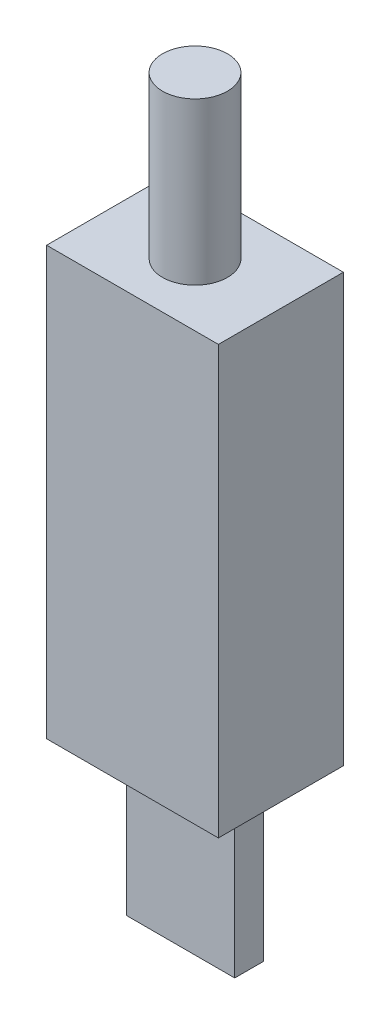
ISO-10303-21;
HEADER;
FILE_DESCRIPTION(('STEP AP214'),'2;1');
FILE_NAME('part.step','',(''),(''),'','','');
FILE_SCHEMA(('AUTOMOTIVE_DESIGN { 1 0 10303 214 1 1 1 1 }'));
ENDSEC;
DATA;
#1=APPLICATION_CONTEXT('core data for automotive mechanical design processes');
#2=APPLICATION_PROTOCOL_DEFINITION('international standard','automotive_design',2000,#1);
#3=PRODUCT_CONTEXT('',#1,'mechanical');
#4=PRODUCT('Part','Part','',(#3));
#5=PRODUCT_RELATED_PRODUCT_CATEGORY('part','',(#4));
#6=PRODUCT_DEFINITION_FORMATION('','',#4);
#7=PRODUCT_DEFINITION_CONTEXT('part definition',#1,'design');
#8=PRODUCT_DEFINITION('design','',#6,#7);
#9=PRODUCT_DEFINITION_SHAPE('','',#8);
#10=(LENGTH_UNIT() NAMED_UNIT(*) SI_UNIT(.MILLI.,.METRE.));
#11=(NAMED_UNIT(*) PLANE_ANGLE_UNIT() SI_UNIT($,.RADIAN.));
#12=(NAMED_UNIT(*) SI_UNIT($,.STERADIAN.) SOLID_ANGLE_UNIT());
#13=UNCERTAINTY_MEASURE_WITH_UNIT(LENGTH_MEASURE(1.E-05),#10,'distance_accuracy_value','');
#14=(GEOMETRIC_REPRESENTATION_CONTEXT(3) GLOBAL_UNCERTAINTY_ASSIGNED_CONTEXT((#13)) GLOBAL_UNIT_ASSIGNED_CONTEXT((#10,
#11,#12)) REPRESENTATION_CONTEXT('',''));
#15=CARTESIAN_POINT('',(0.,0.,0.));
#16=DIRECTION('',(0.,0.,1.));
#17=DIRECTION('',(1.,0.,0.));
#18=AXIS2_PLACEMENT_3D('',#15,#16,#17);
#19=CARTESIAN_POINT('',(0.,10.16,0.));
#20=DIRECTION('',(1.,0.,0.));
#21=DIRECTION('',(0.,0.,-1.));
#22=AXIS2_PLACEMENT_3D('',#19,#20,#21);
#23=PLANE('',#22);
#24=DIRECTION('',(0.,0.,1.));
#25=VECTOR('',#24,1.);
#26=CARTESIAN_POINT('',(0.,0.,0.));
#27=LINE('',#26,#25);
#28=CARTESIAN_POINT('',(0.,0.,-1.8034));
#29=VERTEX_POINT('',#28);
#30=CARTESIAN_POINT('',(0.,0.,0.));
#31=VERTEX_POINT('',#30);
#32=EDGE_CURVE('E132',#29,#31,#27,.T.);
#33=ORIENTED_EDGE('',*,*,#32,.T.);
#34=DIRECTION('',(0.,-1.,0.));
#35=VECTOR('',#34,1.);
#36=CARTESIAN_POINT('',(0.,10.16,0.));
#37=LINE('',#36,#35);
#38=CARTESIAN_POINT('',(0.,10.16,0.));
#39=VERTEX_POINT('',#38);
#40=EDGE_CURVE('E41',#39,#31,#37,.T.);
#41=ORIENTED_EDGE('',*,*,#40,.F.);
#42=DIRECTION('',(0.,0.,1.));
#43=VECTOR('',#42,1.);
#44=CARTESIAN_POINT('',(0.,10.16,0.));
#45=LINE('',#44,#43);
#46=CARTESIAN_POINT('',(0.,10.16,-1.8034));
#47=VERTEX_POINT('',#46);
#48=EDGE_CURVE('E141',#47,#39,#45,.T.);
#49=ORIENTED_EDGE('',*,*,#48,.F.);
#50=DIRECTION('',(0.,-1.,0.));
#51=VECTOR('',#50,1.);
#52=CARTESIAN_POINT('',(0.,10.16,-1.8034));
#53=LINE('',#52,#51);
#54=EDGE_CURVE('E150',#47,#29,#53,.T.);
#55=ORIENTED_EDGE('',*,*,#54,.T.);
#56=EDGE_LOOP('',(#33,#41,#49,#55));
#57=FACE_BOUND('',#56,.T.);
#58=ADVANCED_FACE('F33',(#57),#23,.F.);
#59=CARTESIAN_POINT('',(0.,10.16,0.));
#60=DIRECTION('',(0.,0.,-1.));
#61=DIRECTION('',(-1.,0.,0.));
#62=AXIS2_PLACEMENT_3D('',#59,#60,#61);
#63=PLANE('',#62);
#64=DIRECTION('',(1.,0.,0.));
#65=VECTOR('',#64,1.);
#66=CARTESIAN_POINT('',(0.,0.,0.));
#67=LINE('',#66,#65);
#68=CARTESIAN_POINT('',(6.8072,0.,0.));
#69=VERTEX_POINT('',#68);
#70=EDGE_CURVE('E135',#31,#69,#67,.T.);
#71=ORIENTED_EDGE('',*,*,#70,.T.);
#72=DIRECTION('',(0.,-1.,0.));
#73=VECTOR('',#72,1.);
#74=CARTESIAN_POINT('',(6.8072,10.16,0.));
#75=LINE('',#74,#73);
#76=CARTESIAN_POINT('',(6.8072,10.16,0.));
#77=VERTEX_POINT('',#76);
#78=EDGE_CURVE('E157',#77,#69,#75,.T.);
#79=ORIENTED_EDGE('',*,*,#78,.F.);
#80=DIRECTION('',(1.,0.,0.));
#81=VECTOR('',#80,1.);
#82=CARTESIAN_POINT('',(0.,10.16,0.));
#83=LINE('',#82,#81);
#84=EDGE_CURVE('E76',#39,#77,#83,.T.);
#85=ORIENTED_EDGE('',*,*,#84,.F.);
#86=ORIENTED_EDGE('',*,*,#40,.T.);
#87=EDGE_LOOP('',(#71,#79,#85,#86));
#88=FACE_BOUND('',#87,.T.);
#89=ADVANCED_FACE('F158',(#88),#63,.F.);
#90=CARTESIAN_POINT('',(6.8072,10.16,0.));
#91=DIRECTION('',(-1.,0.,0.));
#92=DIRECTION('',(0.,0.,1.));
#93=AXIS2_PLACEMENT_3D('',#90,#91,#92);
#94=PLANE('',#93);
#95=DIRECTION('',(0.,0.,-1.));
#96=VECTOR('',#95,1.);
#97=CARTESIAN_POINT('',(6.8072,0.,0.));
#98=LINE('',#97,#96);
#99=CARTESIAN_POINT('',(6.8072,0.,-1.8034));
#100=VERTEX_POINT('',#99);
#101=EDGE_CURVE('E65',#69,#100,#98,.T.);
#102=ORIENTED_EDGE('',*,*,#101,.T.);
#103=DIRECTION('',(0.,-1.,0.));
#104=VECTOR('',#103,1.);
#105=CARTESIAN_POINT('',(6.8072,10.16,-1.8034));
#106=LINE('',#105,#104);
#107=CARTESIAN_POINT('',(6.8072,10.16,-1.8034));
#108=VERTEX_POINT('',#107);
#109=EDGE_CURVE('E49',#108,#100,#106,.T.);
#110=ORIENTED_EDGE('',*,*,#109,.F.);
#111=DIRECTION('',(0.,0.,-1.));
#112=VECTOR('',#111,1.);
#113=CARTESIAN_POINT('',(6.8072,10.16,0.));
#114=LINE('',#113,#112);
#115=EDGE_CURVE('E145',#77,#108,#114,.T.);
#116=ORIENTED_EDGE('',*,*,#115,.F.);
#117=ORIENTED_EDGE('',*,*,#78,.T.);
#118=EDGE_LOOP('',(#102,#110,#116,#117));
#119=FACE_BOUND('',#118,.T.);
#120=ADVANCED_FACE('F173',(#119),#94,.F.);
#121=CARTESIAN_POINT('',(0.,10.16,-1.8034));
#122=DIRECTION('',(0.,0.,1.));
#123=DIRECTION('',(1.,0.,0.));
#124=AXIS2_PLACEMENT_3D('',#121,#122,#123);
#125=PLANE('',#124);
#126=DIRECTION('',(-1.,0.,0.));
#127=VECTOR('',#126,1.);
#128=CARTESIAN_POINT('',(0.,0.,-1.8034));
#129=LINE('',#128,#127);
#130=EDGE_CURVE('E70',#100,#29,#129,.T.);
#131=ORIENTED_EDGE('',*,*,#130,.T.);
#132=ORIENTED_EDGE('',*,*,#54,.F.);
#133=DIRECTION('',(-1.,0.,0.));
#134=VECTOR('',#133,1.);
#135=CARTESIAN_POINT('',(0.,10.16,-1.8034));
#136=LINE('',#135,#134);
#137=EDGE_CURVE('E148',#108,#47,#136,.T.);
#138=ORIENTED_EDGE('',*,*,#137,.F.);
#139=ORIENTED_EDGE('',*,*,#109,.T.);
#140=EDGE_LOOP('',(#131,#132,#138,#139));
#141=FACE_BOUND('',#140,.T.);
#142=ADVANCED_FACE('F165',(#141),#125,.F.);
#143=CARTESIAN_POINT('',(0.,0.,0.));
#144=DIRECTION('',(0.,-1.,0.));
#145=DIRECTION('',(0.,0.,-1.));
#146=AXIS2_PLACEMENT_3D('',#143,#144,#145);
#147=PLANE('',#146);
#148=ORIENTED_EDGE('',*,*,#32,.F.);
#149=ORIENTED_EDGE('',*,*,#130,.F.);
#150=ORIENTED_EDGE('',*,*,#101,.F.);
#151=ORIENTED_EDGE('',*,*,#70,.F.);
#152=EDGE_LOOP('',(#148,#149,#150,#151));
#153=FACE_BOUND('',#152,.T.);
#154=ADVANCED_FACE('F162',(#153),#147,.T.);
#155=CARTESIAN_POINT('',(0.,10.16,0.));
#156=DIRECTION('',(0.,-1.,0.));
#157=DIRECTION('',(0.,0.,-1.));
#158=AXIS2_PLACEMENT_3D('',#155,#156,#157);
#159=PLANE('',#158);
#160=DIRECTION('',(0.,0.,1.));
#161=VECTOR('',#160,1.);
#162=CARTESIAN_POINT('',(-2.0066,10.16,3.0353));
#163=LINE('',#162,#161);
#164=CARTESIAN_POINT('',(-2.0066,10.16,-4.8387));
#165=VERTEX_POINT('',#164);
#166=CARTESIAN_POINT('',(-2.0066,10.16,3.0353));
#167=VERTEX_POINT('',#166);
#168=EDGE_CURVE('E131',#165,#167,#163,.T.);
#169=ORIENTED_EDGE('',*,*,#168,.F.);
#170=DIRECTION('',(-1.,0.,0.));
#171=VECTOR('',#170,1.);
#172=CARTESIAN_POINT('',(-2.0066,10.16,-4.8387));
#173=LINE('',#172,#171);
#174=CARTESIAN_POINT('',(8.8138,10.16,-4.8387));
#175=VERTEX_POINT('',#174);
#176=EDGE_CURVE('E127',#175,#165,#173,.T.);
#177=ORIENTED_EDGE('',*,*,#176,.F.);
#178=DIRECTION('',(0.,0.,-1.));
#179=VECTOR('',#178,1.);
#180=CARTESIAN_POINT('',(8.8138,10.16,3.0353));
#181=LINE('',#180,#179);
#182=CARTESIAN_POINT('',(8.8138,10.16,3.0353));
#183=VERTEX_POINT('',#182);
#184=EDGE_CURVE('E276',#183,#175,#181,.T.);
#185=ORIENTED_EDGE('',*,*,#184,.F.);
#186=DIRECTION('',(1.,0.,0.));
#187=VECTOR('',#186,1.);
#188=CARTESIAN_POINT('',(-2.0066,10.16,3.0353));
#189=LINE('',#188,#187);
#190=EDGE_CURVE('E269',#167,#183,#189,.T.);
#191=ORIENTED_EDGE('',*,*,#190,.F.);
#192=EDGE_LOOP('',(#169,#177,#185,#191));
#193=FACE_BOUND('',#192,.T.);
#194=ORIENTED_EDGE('',*,*,#48,.T.);
#195=ORIENTED_EDGE('',*,*,#84,.T.);
#196=ORIENTED_EDGE('',*,*,#115,.T.);
#197=ORIENTED_EDGE('',*,*,#137,.T.);
#198=EDGE_LOOP('',(#194,#195,#196,#197));
#199=FACE_BOUND('',#198,.T.);
#200=ADVANCED_FACE('F164',(#193,#199),#159,.T.);
#201=CARTESIAN_POINT('',(-2.0066,37.084,3.0353));
#202=DIRECTION('',(1.,0.,0.));
#203=DIRECTION('',(0.,0.,-1.));
#204=AXIS2_PLACEMENT_3D('',#201,#202,#203);
#205=PLANE('',#204);
#206=ORIENTED_EDGE('',*,*,#168,.T.);
#207=DIRECTION('',(0.,-1.,0.));
#208=VECTOR('',#207,1.);
#209=CARTESIAN_POINT('',(-2.0066,37.084,3.0353));
#210=LINE('',#209,#208);
#211=CARTESIAN_POINT('',(-2.0066,37.084,3.0353));
#212=VERTEX_POINT('',#211);
#213=EDGE_CURVE('E111',#212,#167,#210,.T.);
#214=ORIENTED_EDGE('',*,*,#213,.F.);
#215=DIRECTION('',(0.,0.,1.));
#216=VECTOR('',#215,1.);
#217=CARTESIAN_POINT('',(-2.0066,37.084,3.0353));
#218=LINE('',#217,#216);
#219=CARTESIAN_POINT('',(-2.0066,37.084,-4.8387));
#220=VERTEX_POINT('',#219);
#221=EDGE_CURVE('E118',#220,#212,#218,.T.);
#222=ORIENTED_EDGE('',*,*,#221,.F.);
#223=DIRECTION('',(0.,-1.,0.));
#224=VECTOR('',#223,1.);
#225=CARTESIAN_POINT('',(-2.0066,37.084,-4.8387));
#226=LINE('',#225,#224);
#227=EDGE_CURVE('E273',#220,#165,#226,.T.);
#228=ORIENTED_EDGE('',*,*,#227,.T.);
#229=EDGE_LOOP('',(#206,#214,#222,#228));
#230=FACE_BOUND('',#229,.T.);
#231=ADVANCED_FACE('F129',(#230),#205,.F.);
#232=CARTESIAN_POINT('',(-2.0066,37.084,3.0353));
#233=DIRECTION('',(0.,0.,-1.));
#234=DIRECTION('',(-1.,0.,0.));
#235=AXIS2_PLACEMENT_3D('',#232,#233,#234);
#236=PLANE('',#235);
#237=ORIENTED_EDGE('',*,*,#190,.T.);
#238=DIRECTION('',(0.,-1.,0.));
#239=VECTOR('',#238,1.);
#240=CARTESIAN_POINT('',(8.8138,37.084,3.0353));
#241=LINE('',#240,#239);
#242=CARTESIAN_POINT('',(8.8138,37.084,3.0353));
#243=VERTEX_POINT('',#242);
#244=EDGE_CURVE('E114',#243,#183,#241,.T.);
#245=ORIENTED_EDGE('',*,*,#244,.F.);
#246=DIRECTION('',(1.,0.,0.));
#247=VECTOR('',#246,1.);
#248=CARTESIAN_POINT('',(-2.0066,37.084,3.0353));
#249=LINE('',#248,#247);
#250=EDGE_CURVE('E107',#212,#243,#249,.T.);
#251=ORIENTED_EDGE('',*,*,#250,.F.);
#252=ORIENTED_EDGE('',*,*,#213,.T.);
#253=EDGE_LOOP('',(#237,#245,#251,#252));
#254=FACE_BOUND('',#253,.T.);
#255=ADVANCED_FACE('F109',(#254),#236,.F.);
#256=CARTESIAN_POINT('',(8.8138,37.084,3.0353));
#257=DIRECTION('',(-1.,0.,0.));
#258=DIRECTION('',(0.,0.,1.));
#259=AXIS2_PLACEMENT_3D('',#256,#257,#258);
#260=PLANE('',#259);
#261=ORIENTED_EDGE('',*,*,#184,.T.);
#262=DIRECTION('',(0.,-1.,0.));
#263=VECTOR('',#262,1.);
#264=CARTESIAN_POINT('',(8.8138,37.084,-4.8387));
#265=LINE('',#264,#263);
#266=CARTESIAN_POINT('',(8.8138,37.084,-4.8387));
#267=VERTEX_POINT('',#266);
#268=EDGE_CURVE('E137',#267,#175,#265,.T.);
#269=ORIENTED_EDGE('',*,*,#268,.F.);
#270=DIRECTION('',(0.,0.,-1.));
#271=VECTOR('',#270,1.);
#272=CARTESIAN_POINT('',(8.8138,37.084,3.0353));
#273=LINE('',#272,#271);
#274=EDGE_CURVE('E117',#243,#267,#273,.T.);
#275=ORIENTED_EDGE('',*,*,#274,.F.);
#276=ORIENTED_EDGE('',*,*,#244,.T.);
#277=EDGE_LOOP('',(#261,#269,#275,#276));
#278=FACE_BOUND('',#277,.T.);
#279=ADVANCED_FACE('F213',(#278),#260,.F.);
#280=CARTESIAN_POINT('',(-2.0066,37.084,-4.8387));
#281=DIRECTION('',(0.,0.,1.));
#282=DIRECTION('',(1.,0.,0.));
#283=AXIS2_PLACEMENT_3D('',#280,#281,#282);
#284=PLANE('',#283);
#285=ORIENTED_EDGE('',*,*,#176,.T.);
#286=ORIENTED_EDGE('',*,*,#227,.F.);
#287=DIRECTION('',(-1.,0.,0.));
#288=VECTOR('',#287,1.);
#289=CARTESIAN_POINT('',(-2.0066,37.084,-4.8387));
#290=LINE('',#289,#288);
#291=EDGE_CURVE('E123',#267,#220,#290,.T.);
#292=ORIENTED_EDGE('',*,*,#291,.F.);
#293=ORIENTED_EDGE('',*,*,#268,.T.);
#294=EDGE_LOOP('',(#285,#286,#292,#293));
#295=FACE_BOUND('',#294,.T.);
#296=ADVANCED_FACE('F222',(#295),#284,.F.);
#297=CARTESIAN_POINT('',(0.,37.084,0.));
#298=DIRECTION('',(0.,-1.,0.));
#299=DIRECTION('',(0.,0.,-1.));
#300=AXIS2_PLACEMENT_3D('',#297,#298,#299);
#301=PLANE('',#300);
#302=CARTESIAN_POINT('',(3.4036,37.084,-0.9017));
#303=DIRECTION('',(0.,-1.,0.));
#304=DIRECTION('',(0.,0.,-1.));
#305=AXIS2_PLACEMENT_3D('',#302,#303,#304);
#306=CIRCLE('',#305,2.0447);
#307=CARTESIAN_POINT('',(3.4036,37.084,-2.9464));
#308=VERTEX_POINT('',#307);
#309=EDGE_CURVE('E11',#308,#308,#306,.F.);
#310=ORIENTED_EDGE('',*,*,#309,.F.);
#311=EDGE_LOOP('',(#310));
#312=FACE_BOUND('',#311,.T.);
#313=ORIENTED_EDGE('',*,*,#221,.T.);
#314=ORIENTED_EDGE('',*,*,#250,.T.);
#315=ORIENTED_EDGE('',*,*,#274,.T.);
#316=ORIENTED_EDGE('',*,*,#291,.T.);
#317=EDGE_LOOP('',(#313,#314,#315,#316));
#318=FACE_BOUND('',#317,.T.);
#319=ADVANCED_FACE('F121',(#312,#318),#301,.F.);
#320=CARTESIAN_POINT('',(3.4036,47.244,-0.9017));
#321=DIRECTION('',(0.,-1.,0.));
#322=DIRECTION('',(0.,0.,-1.));
#323=AXIS2_PLACEMENT_3D('',#320,#321,#322);
#324=CYLINDRICAL_SURFACE('',#323,2.0447);
#325=CARTESIAN_POINT('',(3.4036,47.244,-0.9017));
#326=DIRECTION('',(0.,1.,0.));
#327=DIRECTION('',(0.,0.,1.));
#328=AXIS2_PLACEMENT_3D('',#325,#326,#327);
#329=CIRCLE('',#328,2.0447);
#330=CARTESIAN_POINT('',(3.4036,47.244,1.143));
#331=VERTEX_POINT('',#330);
#332=EDGE_CURVE('E267',#331,#331,#329,.T.);
#333=ORIENTED_EDGE('',*,*,#332,.F.);
#334=EDGE_LOOP('',(#333));
#335=FACE_BOUND('',#334,.T.);
#336=ORIENTED_EDGE('',*,*,#309,.T.);
#337=EDGE_LOOP('',(#336));
#338=FACE_BOUND('',#337,.T.);
#339=ADVANCED_FACE('F241',(#335,#338),#324,.T.);
#340=CARTESIAN_POINT('',(3.4036,47.244,-0.9017));
#341=DIRECTION('',(0.,1.,0.));
#342=DIRECTION('',(0.,0.,1.));
#343=AXIS2_PLACEMENT_3D('',#340,#341,#342);
#344=PLANE('',#343);
#345=ORIENTED_EDGE('',*,*,#332,.T.);
#346=EDGE_LOOP('',(#345));
#347=FACE_BOUND('',#346,.T.);
#348=ADVANCED_FACE('F251',(#347),#344,.T.);
#349=CLOSED_SHELL('',(#58,#89,#120,#142,#154,#200,#231,#255,#279,#296,#319,#339,#348));
#350=MANIFOLD_SOLID_BREP('B2',#349);
#351=ADVANCED_BREP_SHAPE_REPRESENTATION('',(#18,#350),#14);
#352=SHAPE_DEFINITION_REPRESENTATION(#9,#351);
ENDSEC;
END-ISO-10303-21;
